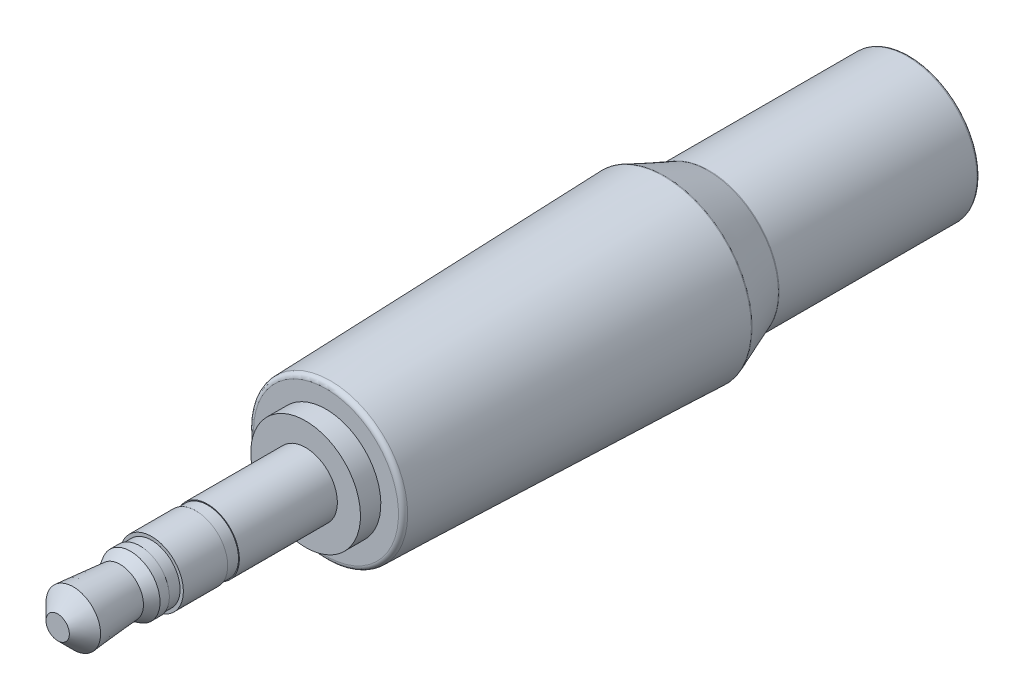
ISO-10303-21;
HEADER;
FILE_DESCRIPTION(('STEP AP214'),'2;1');
FILE_NAME('part.step','',(''),(''),'','','');
FILE_SCHEMA(('AUTOMOTIVE_DESIGN { 1 0 10303 214 1 1 1 1 }'));
ENDSEC;
DATA;
#1=APPLICATION_CONTEXT('core data for automotive mechanical design processes');
#2=APPLICATION_PROTOCOL_DEFINITION('international standard','automotive_design',2000,#1);
#3=PRODUCT_CONTEXT('',#1,'mechanical');
#4=PRODUCT('Part','Part','',(#3));
#5=PRODUCT_RELATED_PRODUCT_CATEGORY('part','',(#4));
#6=PRODUCT_DEFINITION_FORMATION('','',#4);
#7=PRODUCT_DEFINITION_CONTEXT('part definition',#1,'design');
#8=PRODUCT_DEFINITION('design','',#6,#7);
#9=PRODUCT_DEFINITION_SHAPE('','',#8);
#10=(LENGTH_UNIT() NAMED_UNIT(*) SI_UNIT(.MILLI.,.METRE.));
#11=(NAMED_UNIT(*) PLANE_ANGLE_UNIT() SI_UNIT($,.RADIAN.));
#12=(NAMED_UNIT(*) SI_UNIT($,.STERADIAN.) SOLID_ANGLE_UNIT());
#13=UNCERTAINTY_MEASURE_WITH_UNIT(LENGTH_MEASURE(1.E-05),#10,'distance_accuracy_value','');
#14=(GEOMETRIC_REPRESENTATION_CONTEXT(3) GLOBAL_UNCERTAINTY_ASSIGNED_CONTEXT((#13)) GLOBAL_UNIT_ASSIGNED_CONTEXT((#10,
#11,#12)) REPRESENTATION_CONTEXT('',''));
#15=CARTESIAN_POINT('',(0.,0.,0.));
#16=DIRECTION('',(0.,0.,1.));
#17=DIRECTION('',(1.,0.,0.));
#18=AXIS2_PLACEMENT_3D('',#15,#16,#17);
#19=CARTESIAN_POINT('',(0.,0.,0.));
#20=DIRECTION('',(0.,0.,-1.));
#21=DIRECTION('',(0.,1.,0.));
#22=AXIS2_PLACEMENT_3D('',#19,#20,#21);
#23=PLANE('',#22);
#24=CARTESIAN_POINT('',(0.,0.,0.));
#25=DIRECTION('',(0.,0.,1.));
#26=DIRECTION('',(0.,-1.,0.));
#27=AXIS2_PLACEMENT_3D('',#24,#25,#26);
#28=CIRCLE('',#27,0.635);
#29=CARTESIAN_POINT('',(0.,-0.635,0.));
#30=VERTEX_POINT('',#29);
#31=EDGE_CURVE('E103',#30,#30,#28,.T.);
#32=ORIENTED_EDGE('',*,*,#31,.T.);
#33=EDGE_LOOP('',(#32));
#34=FACE_BOUND('',#33,.T.);
#35=ADVANCED_FACE('F32',(#34),#23,.F.);
#36=CARTESIAN_POINT('',(0.,0.,0.));
#37=DIRECTION('',(0.,0.,1.));
#38=DIRECTION('',(0.,-1.,0.));
#39=AXIS2_PLACEMENT_3D('',#36,#37,#38);
#40=CYLINDRICAL_SURFACE('',#39,2.9845);
#41=CARTESIAN_POINT('',(0.,0.,-13.4960295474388));
#42=DIRECTION('',(0.,0.,1.));
#43=DIRECTION('',(0.,-1.,0.));
#44=AXIS2_PLACEMENT_3D('',#41,#42,#43);
#45=CIRCLE('',#44,2.9845);
#46=CARTESIAN_POINT('',(0.,-2.9845,-13.4960295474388));
#47=VERTEX_POINT('',#46);
#48=EDGE_CURVE('E64',#47,#47,#45,.T.);
#49=ORIENTED_EDGE('',*,*,#48,.F.);
#50=EDGE_LOOP('',(#49));
#51=FACE_BOUND('',#50,.T.);
#52=CARTESIAN_POINT('',(0.,0.,-14.605));
#53=DIRECTION('',(0.,0.,-1.));
#54=DIRECTION('',(-1.,0.,0.));
#55=AXIS2_PLACEMENT_3D('',#52,#53,#54);
#56=CIRCLE('',#55,2.9845);
#57=CARTESIAN_POINT('',(-2.9845,0.,-14.605));
#58=VERTEX_POINT('',#57);
#59=EDGE_CURVE('E106',#58,#58,#56,.T.);
#60=ORIENTED_EDGE('',*,*,#59,.F.);
#61=EDGE_LOOP('',(#60));
#62=FACE_BOUND('',#61,.T.);
#63=ADVANCED_FACE('F112',(#51,#62),#40,.T.);
#64=CARTESIAN_POINT('',(0.,1.7272,-13.4960295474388));
#65=DIRECTION('',(0.,0.,-1.));
#66=DIRECTION('',(0.,1.,0.));
#67=AXIS2_PLACEMENT_3D('',#64,#65,#66);
#68=PLANE('',#67);
#69=CARTESIAN_POINT('',(0.,0.,-13.4960295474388));
#70=DIRECTION('',(0.,0.,1.));
#71=DIRECTION('',(0.,-1.,0.));
#72=AXIS2_PLACEMENT_3D('',#69,#70,#71);
#73=CIRCLE('',#72,1.7272);
#74=CARTESIAN_POINT('',(0.,-1.7272,-13.4960295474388));
#75=VERTEX_POINT('',#74);
#76=EDGE_CURVE('E67',#75,#75,#73,.T.);
#77=ORIENTED_EDGE('',*,*,#76,.F.);
#78=EDGE_LOOP('',(#77));
#79=FACE_BOUND('',#78,.T.);
#80=ORIENTED_EDGE('',*,*,#48,.T.);
#81=EDGE_LOOP('',(#80));
#82=FACE_BOUND('',#81,.T.);
#83=ADVANCED_FACE('F114',(#79,#82),#68,.F.);
#84=CARTESIAN_POINT('',(0.,0.,0.));
#85=DIRECTION('',(0.,0.,1.));
#86=DIRECTION('',(0.,-1.,0.));
#87=AXIS2_PLACEMENT_3D('',#84,#85,#86);
#88=CYLINDRICAL_SURFACE('',#87,1.7272);
#89=CARTESIAN_POINT('',(0.,0.,-8.16202954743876));
#90=DIRECTION('',(0.,0.,1.));
#91=DIRECTION('',(0.,-1.,0.));
#92=AXIS2_PLACEMENT_3D('',#89,#90,#91);
#93=CIRCLE('',#92,1.7272);
#94=CARTESIAN_POINT('',(0.,-1.7272,-8.16202954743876));
#95=VERTEX_POINT('',#94);
#96=EDGE_CURVE('E70',#95,#95,#93,.T.);
#97=ORIENTED_EDGE('',*,*,#96,.F.);
#98=EDGE_LOOP('',(#97));
#99=FACE_BOUND('',#98,.T.);
#100=ORIENTED_EDGE('',*,*,#76,.T.);
#101=EDGE_LOOP('',(#100));
#102=FACE_BOUND('',#101,.T.);
#103=ADVANCED_FACE('F121',(#99,#102),#88,.T.);
#104=CARTESIAN_POINT('',(0.,1.68275,-8.16202954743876));
#105=DIRECTION('',(0.,0.,-1.));
#106=DIRECTION('',(0.,1.,0.));
#107=AXIS2_PLACEMENT_3D('',#104,#105,#106);
#108=PLANE('',#107);
#109=CARTESIAN_POINT('',(0.,0.,-8.16202954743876));
#110=DIRECTION('',(0.,0.,1.));
#111=DIRECTION('',(0.,-1.,0.));
#112=AXIS2_PLACEMENT_3D('',#109,#110,#111);
#113=CIRCLE('',#112,1.68275);
#114=CARTESIAN_POINT('',(0.,-1.68275,-8.16202954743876));
#115=VERTEX_POINT('',#114);
#116=EDGE_CURVE('E73',#115,#115,#113,.T.);
#117=ORIENTED_EDGE('',*,*,#116,.F.);
#118=EDGE_LOOP('',(#117));
#119=FACE_BOUND('',#118,.T.);
#120=ORIENTED_EDGE('',*,*,#96,.T.);
#121=EDGE_LOOP('',(#120));
#122=FACE_BOUND('',#121,.T.);
#123=ADVANCED_FACE('F213',(#119,#122),#108,.F.);
#124=CARTESIAN_POINT('',(0.,0.,0.));
#125=DIRECTION('',(0.,0.,1.));
#126=DIRECTION('',(0.,-1.,0.));
#127=AXIS2_PLACEMENT_3D('',#124,#125,#126);
#128=CYLINDRICAL_SURFACE('',#127,1.68275);
#129=CARTESIAN_POINT('',(0.,0.,-7.52702954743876));
#130=DIRECTION('',(0.,0.,1.));
#131=DIRECTION('',(0.,-1.,0.));
#132=AXIS2_PLACEMENT_3D('',#129,#130,#131);
#133=CIRCLE('',#132,1.68275);
#134=CARTESIAN_POINT('',(0.,-1.68275,-7.52702954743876));
#135=VERTEX_POINT('',#134);
#136=EDGE_CURVE('E76',#135,#135,#133,.T.);
#137=ORIENTED_EDGE('',*,*,#136,.F.);
#138=EDGE_LOOP('',(#137));
#139=FACE_BOUND('',#138,.T.);
#140=ORIENTED_EDGE('',*,*,#116,.T.);
#141=EDGE_LOOP('',(#140));
#142=FACE_BOUND('',#141,.T.);
#143=ADVANCED_FACE('F209',(#139,#142),#128,.T.);
#144=CARTESIAN_POINT('',(0.,1.7272,-7.52702954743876));
#145=DIRECTION('',(0.,0.,1.));
#146=DIRECTION('',(0.,-1.,0.));
#147=AXIS2_PLACEMENT_3D('',#144,#145,#146);
#148=PLANE('',#147);
#149=CARTESIAN_POINT('',(0.,0.,-7.52702954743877));
#150=DIRECTION('',(0.,0.,1.));
#151=DIRECTION('',(0.,-1.,0.));
#152=AXIS2_PLACEMENT_3D('',#149,#150,#151);
#153=CIRCLE('',#152,1.7272);
#154=CARTESIAN_POINT('',(0.,-1.7272,-7.52702954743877));
#155=VERTEX_POINT('',#154);
#156=EDGE_CURVE('E79',#155,#155,#153,.T.);
#157=ORIENTED_EDGE('',*,*,#156,.F.);
#158=EDGE_LOOP('',(#157));
#159=FACE_BOUND('',#158,.T.);
#160=ORIENTED_EDGE('',*,*,#136,.T.);
#161=EDGE_LOOP('',(#160));
#162=FACE_BOUND('',#161,.T.);
#163=ADVANCED_FACE('F205',(#159,#162),#148,.F.);
#164=CARTESIAN_POINT('',(0.,0.,0.));
#165=DIRECTION('',(0.,0.,1.));
#166=DIRECTION('',(0.,-1.,0.));
#167=AXIS2_PLACEMENT_3D('',#164,#165,#166);
#168=CYLINDRICAL_SURFACE('',#167,1.7272);
#169=CARTESIAN_POINT('',(0.,0.,-5.11402954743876));
#170=DIRECTION('',(0.,0.,1.));
#171=DIRECTION('',(0.,-1.,0.));
#172=AXIS2_PLACEMENT_3D('',#169,#170,#171);
#173=CIRCLE('',#172,1.7272);
#174=CARTESIAN_POINT('',(0.,-1.7272,-5.11402954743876));
#175=VERTEX_POINT('',#174);
#176=EDGE_CURVE('E82',#175,#175,#173,.T.);
#177=ORIENTED_EDGE('',*,*,#176,.F.);
#178=EDGE_LOOP('',(#177));
#179=FACE_BOUND('',#178,.T.);
#180=ORIENTED_EDGE('',*,*,#156,.T.);
#181=EDGE_LOOP('',(#180));
#182=FACE_BOUND('',#181,.T.);
#183=ADVANCED_FACE('F201',(#179,#182),#168,.T.);
#184=CARTESIAN_POINT('',(0.,1.5494,-5.11402954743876));
#185=DIRECTION('',(0.,0.,-1.));
#186=DIRECTION('',(0.,1.,0.));
#187=AXIS2_PLACEMENT_3D('',#184,#185,#186);
#188=PLANE('',#187);
#189=CARTESIAN_POINT('',(0.,0.,-5.11402954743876));
#190=DIRECTION('',(0.,0.,1.));
#191=DIRECTION('',(0.,-1.,0.));
#192=AXIS2_PLACEMENT_3D('',#189,#190,#191);
#193=CIRCLE('',#192,1.5494);
#194=CARTESIAN_POINT('',(0.,-1.5494,-5.11402954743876));
#195=VERTEX_POINT('',#194);
#196=EDGE_CURVE('E85',#195,#195,#193,.T.);
#197=ORIENTED_EDGE('',*,*,#196,.F.);
#198=EDGE_LOOP('',(#197));
#199=FACE_BOUND('',#198,.T.);
#200=ORIENTED_EDGE('',*,*,#176,.T.);
#201=EDGE_LOOP('',(#200));
#202=FACE_BOUND('',#201,.T.);
#203=ADVANCED_FACE('F197',(#199,#202),#188,.F.);
#204=CARTESIAN_POINT('',(0.,0.,0.));
#205=DIRECTION('',(0.,0.,1.));
#206=DIRECTION('',(0.,-1.,0.));
#207=AXIS2_PLACEMENT_3D('',#204,#205,#206);
#208=CYLINDRICAL_SURFACE('',#207,1.5494);
#209=CARTESIAN_POINT('',(0.,0.,-4.47902954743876));
#210=DIRECTION('',(0.,0.,1.));
#211=DIRECTION('',(0.,-1.,0.));
#212=AXIS2_PLACEMENT_3D('',#209,#210,#211);
#213=CIRCLE('',#212,1.5494);
#214=CARTESIAN_POINT('',(0.,-1.5494,-4.47902954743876));
#215=VERTEX_POINT('',#214);
#216=EDGE_CURVE('E88',#215,#215,#213,.T.);
#217=ORIENTED_EDGE('',*,*,#216,.F.);
#218=EDGE_LOOP('',(#217));
#219=FACE_BOUND('',#218,.T.);
#220=ORIENTED_EDGE('',*,*,#196,.T.);
#221=EDGE_LOOP('',(#220));
#222=FACE_BOUND('',#221,.T.);
#223=ADVANCED_FACE('F193',(#219,#222),#208,.T.);
#224=CARTESIAN_POINT('',(0.,1.6002,-4.47902954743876));
#225=DIRECTION('',(0.,0.,1.));
#226=DIRECTION('',(0.,-1.,0.));
#227=AXIS2_PLACEMENT_3D('',#224,#225,#226);
#228=PLANE('',#227);
#229=CARTESIAN_POINT('',(0.,0.,-4.47902954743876));
#230=DIRECTION('',(0.,0.,1.));
#231=DIRECTION('',(0.,-1.,0.));
#232=AXIS2_PLACEMENT_3D('',#229,#230,#231);
#233=CIRCLE('',#232,1.6002);
#234=CARTESIAN_POINT('',(0.,-1.6002,-4.47902954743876));
#235=VERTEX_POINT('',#234);
#236=EDGE_CURVE('E91',#235,#235,#233,.T.);
#237=ORIENTED_EDGE('',*,*,#236,.F.);
#238=EDGE_LOOP('',(#237));
#239=FACE_BOUND('',#238,.T.);
#240=ORIENTED_EDGE('',*,*,#216,.T.);
#241=EDGE_LOOP('',(#240));
#242=FACE_BOUND('',#241,.T.);
#243=ADVANCED_FACE('F189',(#239,#242),#228,.F.);
#244=CARTESIAN_POINT('',(0.,0.,0.));
#245=DIRECTION('',(0.,0.,1.));
#246=DIRECTION('',(0.,-1.,0.));
#247=AXIS2_PLACEMENT_3D('',#244,#245,#246);
#248=CYLINDRICAL_SURFACE('',#247,1.6002);
#249=CARTESIAN_POINT('',(0.,0.,-3.97102954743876));
#250=DIRECTION('',(0.,0.,1.));
#251=DIRECTION('',(0.,-1.,0.));
#252=AXIS2_PLACEMENT_3D('',#249,#250,#251);
#253=CIRCLE('',#252,1.6002);
#254=CARTESIAN_POINT('',(0.,-1.6002,-3.97102954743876));
#255=VERTEX_POINT('',#254);
#256=EDGE_CURVE('E94',#255,#255,#253,.T.);
#257=ORIENTED_EDGE('',*,*,#256,.F.);
#258=EDGE_LOOP('',(#257));
#259=FACE_BOUND('',#258,.T.);
#260=ORIENTED_EDGE('',*,*,#236,.T.);
#261=EDGE_LOOP('',(#260));
#262=FACE_BOUND('',#261,.T.);
#263=ADVANCED_FACE('F185',(#259,#262),#248,.T.);
#264=CARTESIAN_POINT('',(0.,0.,-3.97102954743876));
#265=DIRECTION('',(0.,0.,-1.));
#266=DIRECTION('',(0.,1.,0.));
#267=AXIS2_PLACEMENT_3D('',#264,#265,#266);
#268=CONICAL_SURFACE('',#267,1.6002,0.523598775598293);
#269=CARTESIAN_POINT('',(0.,0.,-3.39910637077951));
#270=DIRECTION('',(0.,0.,1.));
#271=DIRECTION('',(0.,-1.,0.));
#272=AXIS2_PLACEMENT_3D('',#269,#270,#271);
#273=CIRCLE('',#272,1.27);
#274=CARTESIAN_POINT('',(0.,-1.27,-3.39910637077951));
#275=VERTEX_POINT('',#274);
#276=EDGE_CURVE('E97',#275,#275,#273,.T.);
#277=ORIENTED_EDGE('',*,*,#276,.F.);
#278=EDGE_LOOP('',(#277));
#279=FACE_BOUND('',#278,.T.);
#280=ORIENTED_EDGE('',*,*,#256,.T.);
#281=EDGE_LOOP('',(#280));
#282=FACE_BOUND('',#281,.T.);
#283=ADVANCED_FACE('F181',(#279,#282),#268,.T.);
#284=CARTESIAN_POINT('',(0.,0.,-3.39910637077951));
#285=DIRECTION('',(0.,0.,1.));
#286=DIRECTION('',(0.,-1.,0.));
#287=AXIS2_PLACEMENT_3D('',#284,#285,#286);
#288=CONICAL_SURFACE('',#287,1.27,0.0845243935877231);
#289=CARTESIAN_POINT('',(0.,0.,-0.850900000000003));
#290=DIRECTION('',(0.,0.,1.));
#291=DIRECTION('',(0.,-1.,0.));
#292=AXIS2_PLACEMENT_3D('',#289,#290,#291);
#293=CIRCLE('',#292,1.4859);
#294=CARTESIAN_POINT('',(0.,-1.4859,-0.850900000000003));
#295=VERTEX_POINT('',#294);
#296=EDGE_CURVE('E100',#295,#295,#293,.T.);
#297=ORIENTED_EDGE('',*,*,#296,.F.);
#298=EDGE_LOOP('',(#297));
#299=FACE_BOUND('',#298,.T.);
#300=ORIENTED_EDGE('',*,*,#276,.T.);
#301=EDGE_LOOP('',(#300));
#302=FACE_BOUND('',#301,.T.);
#303=ADVANCED_FACE('F173',(#299,#302),#288,.T.);
#304=CARTESIAN_POINT('',(0.,0.,-0.850900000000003));
#305=DIRECTION('',(0.,0.,-1.));
#306=DIRECTION('',(0.,1.,0.));
#307=AXIS2_PLACEMENT_3D('',#304,#305,#306);
#308=CONICAL_SURFACE('',#307,1.4859,0.785398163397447);
#309=ORIENTED_EDGE('',*,*,#31,.F.);
#310=EDGE_LOOP('',(#309));
#311=FACE_BOUND('',#310,.T.);
#312=ORIENTED_EDGE('',*,*,#296,.T.);
#313=EDGE_LOOP('',(#312));
#314=FACE_BOUND('',#313,.T.);
#315=ADVANCED_FACE('F166',(#311,#314),#308,.T.);
#316=CARTESIAN_POINT('',(0.,0.,-14.605));
#317=DIRECTION('',(0.,0.,-1.));
#318=DIRECTION('',(-1.,0.,0.));
#319=AXIS2_PLACEMENT_3D('',#316,#317,#318);
#320=PLANE('',#319);
#321=CARTESIAN_POINT('',(0.,0.,-14.605));
#322=DIRECTION('',(0.,0.,-1.));
#323=DIRECTION('',(-1.,0.,0.));
#324=AXIS2_PLACEMENT_3D('',#321,#322,#323);
#325=CIRCLE('',#324,3.94476046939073);
#326=CARTESIAN_POINT('',(-3.94476046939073,0.,-14.605));
#327=VERTEX_POINT('',#326);
#328=EDGE_CURVE('E61',#327,#327,#325,.F.);
#329=ORIENTED_EDGE('',*,*,#328,.T.);
#330=EDGE_LOOP('',(#329));
#331=FACE_BOUND('',#330,.T.);
#332=ORIENTED_EDGE('',*,*,#59,.T.);
#333=EDGE_LOOP('',(#332));
#334=FACE_BOUND('',#333,.T.);
#335=ADVANCED_FACE('F110',(#331,#334),#320,.F.);
#336=CARTESIAN_POINT('',(0.,0.,-46.355));
#337=DIRECTION('',(0.,0.,1.));
#338=DIRECTION('',(1.,0.,0.));
#339=AXIS2_PLACEMENT_3D('',#336,#337,#338);
#340=PLANE('',#339);
#341=CARTESIAN_POINT('',(0.,0.,-46.355));
#342=DIRECTION('',(0.,0.,1.));
#343=DIRECTION('',(1.,0.,0.));
#344=AXIS2_PLACEMENT_3D('',#341,#342,#343);
#345=CIRCLE('',#344,3.683);
#346=CARTESIAN_POINT('',(3.683,0.,-46.355));
#347=VERTEX_POINT('',#346);
#348=EDGE_CURVE('E10',#347,#347,#345,.F.);
#349=ORIENTED_EDGE('',*,*,#348,.T.);
#350=EDGE_LOOP('',(#349));
#351=FACE_BOUND('',#350,.T.);
#352=ADVANCED_FACE('F165',(#351),#340,.F.);
#353=CARTESIAN_POINT('',(0.,0.,-14.605));
#354=DIRECTION('',(0.,0.,1.));
#355=DIRECTION('',(1.,0.,0.));
#356=AXIS2_PLACEMENT_3D('',#353,#354,#355);
#357=CYLINDRICAL_SURFACE('',#356,3.81);
#358=CARTESIAN_POINT('',(0.,0.,-46.228));
#359=DIRECTION('',(0.,0.,1.));
#360=DIRECTION('',(1.,0.,0.));
#361=AXIS2_PLACEMENT_3D('',#358,#359,#360);
#362=CIRCLE('',#361,3.81);
#363=CARTESIAN_POINT('',(3.81,0.,-46.228));
#364=VERTEX_POINT('',#363);
#365=EDGE_CURVE('E39',#364,#364,#362,.T.);
#366=ORIENTED_EDGE('',*,*,#365,.T.);
#367=EDGE_LOOP('',(#366));
#368=FACE_BOUND('',#367,.T.);
#369=CARTESIAN_POINT('',(0.,0.,-35.4571587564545));
#370=DIRECTION('',(0.,0.,1.));
#371=DIRECTION('',(1.,0.,0.));
#372=AXIS2_PLACEMENT_3D('',#369,#370,#371);
#373=CIRCLE('',#372,3.81);
#374=CARTESIAN_POINT('',(3.81,0.,-35.4571587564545));
#375=VERTEX_POINT('',#374);
#376=EDGE_CURVE('E43',#375,#375,#373,.F.);
#377=ORIENTED_EDGE('',*,*,#376,.T.);
#378=EDGE_LOOP('',(#377));
#379=FACE_BOUND('',#378,.T.);
#380=ADVANCED_FACE('F151',(#368,#379),#357,.T.);
#381=CARTESIAN_POINT('',(0.,0.,-35.433));
#382=DIRECTION('',(0.,0.,1.));
#383=DIRECTION('',(1.,0.,0.));
#384=AXIS2_PLACEMENT_3D('',#381,#382,#383);
#385=CONICAL_SURFACE('',#384,3.81,0.375960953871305);
#386=CARTESIAN_POINT('',(0.,0.,-35.410528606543));
#387=DIRECTION('',(0.,0.,1.));
#388=DIRECTION('',(1.,0.,0.));
#389=AXIS2_PLACEMENT_3D('',#386,#387,#388);
#390=CIRCLE('',#389,3.81887028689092);
#391=CARTESIAN_POINT('',(3.81887028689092,0.,-35.410528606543));
#392=VERTEX_POINT('',#391);
#393=EDGE_CURVE('E47',#392,#392,#390,.T.);
#394=ORIENTED_EDGE('',*,*,#393,.T.);
#395=EDGE_LOOP('',(#394));
#396=FACE_BOUND('',#395,.T.);
#397=CARTESIAN_POINT('',(0.,0.,-33.0443759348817));
#398=DIRECTION('',(0.,0.,-1.));
#399=DIRECTION('',(-1.,0.,0.));
#400=AXIS2_PLACEMENT_3D('',#397,#398,#399);
#401=CIRCLE('',#400,4.75287792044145);
#402=CARTESIAN_POINT('',(-4.75287792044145,0.,-33.0443759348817));
#403=VERTEX_POINT('',#402);
#404=EDGE_CURVE('E52',#403,#403,#401,.T.);
#405=ORIENTED_EDGE('',*,*,#404,.T.);
#406=EDGE_LOOP('',(#405));
#407=FACE_BOUND('',#406,.T.);
#408=ADVANCED_FACE('F148',(#396,#407),#385,.T.);
#409=CARTESIAN_POINT('',(0.,0.,-33.02));
#410=DIRECTION('',(0.,0.,-1.));
#411=DIRECTION('',(-1.,0.,0.));
#412=AXIS2_PLACEMENT_3D('',#409,#410,#411);
#413=CONICAL_SURFACE('',#412,4.7625,0.0310245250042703);
#414=CARTESIAN_POINT('',(0.,0.,-32.9938063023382));
#415=DIRECTION('',(0.,0.,1.));
#416=DIRECTION('',(1.,0.,0.));
#417=AXIS2_PLACEMENT_3D('',#414,#415,#416);
#418=CIRCLE('',#417,4.76168709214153);
#419=CARTESIAN_POINT('',(4.76168709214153,0.,-32.9938063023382));
#420=VERTEX_POINT('',#419);
#421=EDGE_CURVE('E55',#420,#420,#418,.T.);
#422=ORIENTED_EDGE('',*,*,#421,.T.);
#423=EDGE_LOOP('',(#422));
#424=FACE_BOUND('',#423,.T.);
#425=CARTESIAN_POINT('',(0.,0.,-14.851121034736));
#426=DIRECTION('',(0.,0.,1.));
#427=DIRECTION('',(1.,0.,0.));
#428=AXIS2_PLACEMENT_3D('',#425,#426,#427);
#429=CIRCLE('',#428,4.19863823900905);
#430=CARTESIAN_POINT('',(4.19863823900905,0.,-14.851121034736));
#431=VERTEX_POINT('',#430);
#432=EDGE_CURVE('E58',#431,#431,#429,.F.);
#433=ORIENTED_EDGE('',*,*,#432,.T.);
#434=EDGE_LOOP('',(#433));
#435=FACE_BOUND('',#434,.T.);
#436=ADVANCED_FACE('F133',(#424,#435),#413,.T.);
#437=CARTESIAN_POINT('',(0.,0.,-14.859));
#438=DIRECTION('',(0.,0.,-1.));
#439=DIRECTION('',(-1.,0.,0.));
#440=AXIS2_PLACEMENT_3D('',#437,#438,#439);
#441=TOROIDAL_SURFACE('',#440,3.94476046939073,0.254);
#442=ORIENTED_EDGE('',*,*,#432,.F.);
#443=EDGE_LOOP('',(#442));
#444=FACE_BOUND('',#443,.T.);
#445=ORIENTED_EDGE('',*,*,#328,.F.);
#446=EDGE_LOOP('',(#445));
#447=FACE_BOUND('',#446,.T.);
#448=ADVANCED_FACE('F129',(#444,#447),#441,.T.);
#449=CARTESIAN_POINT('',(0.,0.,-32.9977457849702));
#450=DIRECTION('',(0.,0.,-1.));
#451=DIRECTION('',(-1.,0.,0.));
#452=AXIS2_PLACEMENT_3D('',#449,#450,#451);
#453=TOROIDAL_SURFACE('',#452,4.63474820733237,0.127);
#454=ORIENTED_EDGE('',*,*,#404,.F.);
#455=EDGE_LOOP('',(#454));
#456=FACE_BOUND('',#455,.T.);
#457=ORIENTED_EDGE('',*,*,#421,.F.);
#458=EDGE_LOOP('',(#457));
#459=FACE_BOUND('',#458,.T.);
#460=ADVANCED_FACE('F132',(#456,#459),#453,.T.);
#461=CARTESIAN_POINT('',(0.,0.,-35.4571587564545));
#462=DIRECTION('',(0.,0.,1.));
#463=DIRECTION('',(1.,0.,0.));
#464=AXIS2_PLACEMENT_3D('',#461,#462,#463);
#465=TOROIDAL_SURFACE('',#464,3.937,0.127);
#466=ORIENTED_EDGE('',*,*,#376,.F.);
#467=EDGE_LOOP('',(#466));
#468=FACE_BOUND('',#467,.T.);
#469=ORIENTED_EDGE('',*,*,#393,.F.);
#470=EDGE_LOOP('',(#469));
#471=FACE_BOUND('',#470,.T.);
#472=ADVANCED_FACE('F136',(#468,#471),#465,.F.);
#473=CARTESIAN_POINT('',(0.,0.,-46.228));
#474=DIRECTION('',(0.,0.,1.));
#475=DIRECTION('',(1.,0.,0.));
#476=AXIS2_PLACEMENT_3D('',#473,#474,#475);
#477=TOROIDAL_SURFACE('',#476,3.683,0.127);
#478=ORIENTED_EDGE('',*,*,#348,.F.);
#479=EDGE_LOOP('',(#478));
#480=FACE_BOUND('',#479,.T.);
#481=ORIENTED_EDGE('',*,*,#365,.F.);
#482=EDGE_LOOP('',(#481));
#483=FACE_BOUND('',#482,.T.);
#484=ADVANCED_FACE('F34',(#480,#483),#477,.T.);
#485=CLOSED_SHELL('',(#35,#63,#83,#103,#123,#143,#163,#183,#203,#223,#243,#263,#283,#303,#315,
#335,#352,#380,#408,#436,#448,#460,#472,#484));
#486=MANIFOLD_SOLID_BREP('B2',#485);
#487=ADVANCED_BREP_SHAPE_REPRESENTATION('',(#18,#486),#14);
#488=SHAPE_DEFINITION_REPRESENTATION(#9,#487);
ENDSEC;
END-ISO-10303-21;
